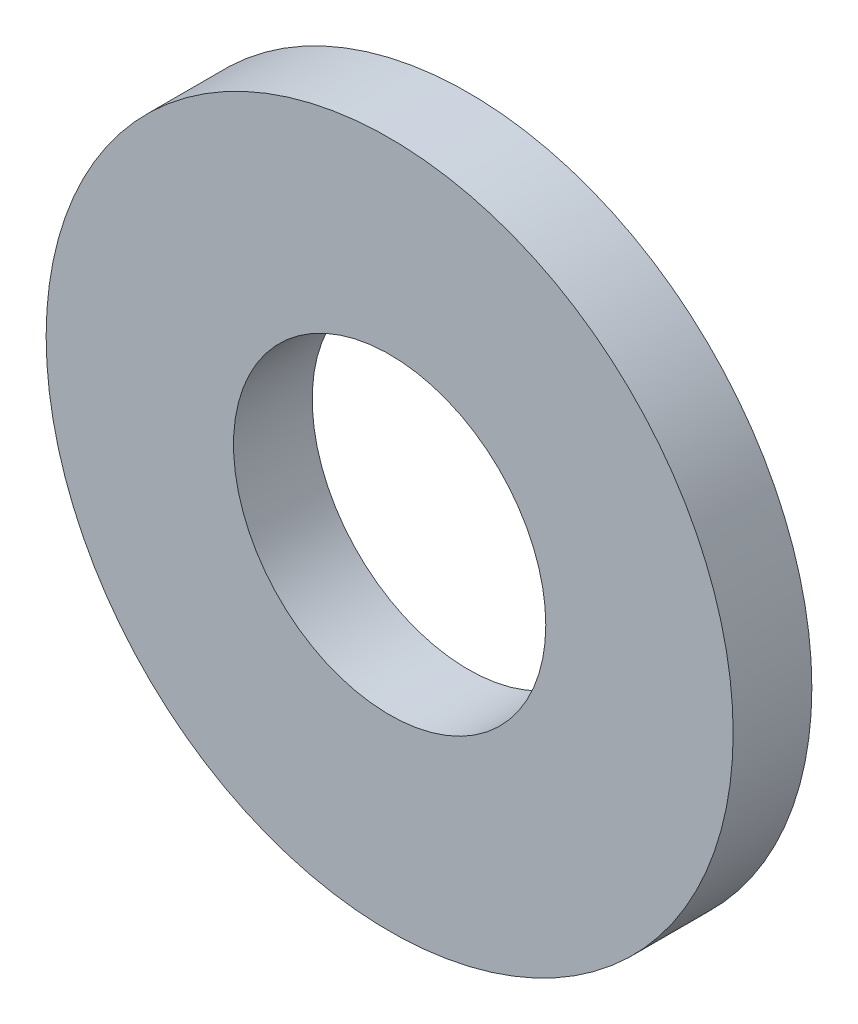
from build123d import *

# Parameters (mm, degrees)
SKETCH1_R          = 6.985
BASE_EXTRUDE_DEPTH = 1.6002
SKETCH2_R          = 3.175
CUT_EXTRUDE1_DEPTH = 11.007052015


with BuildPart() as part:
    # Sketch1 → Base-Extrude (new body)
    with BuildSketch(Plane.XY):
        Circle(SKETCH1_R)
    extrude(amount=BASE_EXTRUDE_DEPTH)

    # Sketch2 → Cut-Extrude1 (cut, through all)
    with BuildSketch(Plane.XY.offset(1.6002)):
        Circle(SKETCH2_R)
    extrude(amount=-CUT_EXTRUDE1_DEPTH, mode=Mode.SUBTRACT)


solid = part.part
